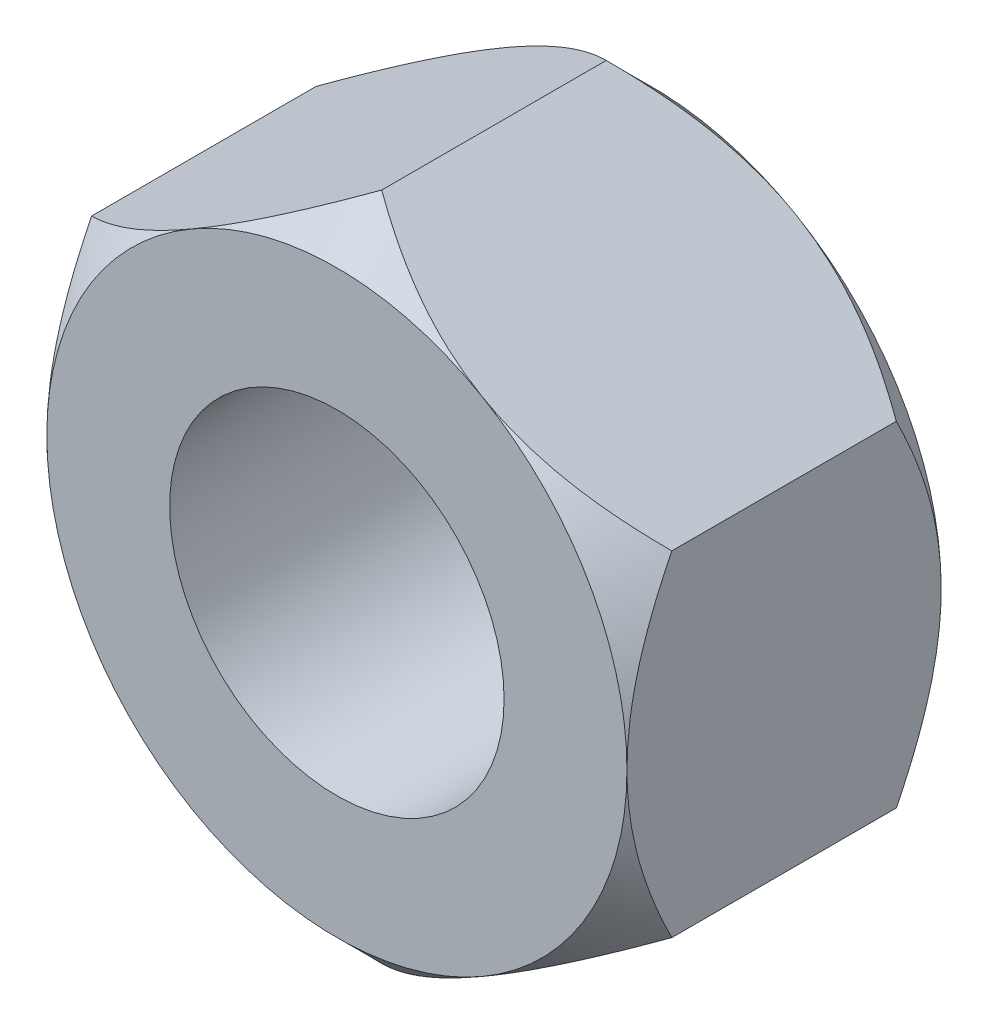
ISO-10303-21;
HEADER;
FILE_DESCRIPTION(('STEP AP214'),'2;1');
FILE_NAME('part.step','',(''),(''),'','','');
FILE_SCHEMA(('AUTOMOTIVE_DESIGN { 1 0 10303 214 1 1 1 1 }'));
ENDSEC;
DATA;
#1=APPLICATION_CONTEXT('core data for automotive mechanical design processes');
#2=APPLICATION_PROTOCOL_DEFINITION('international standard','automotive_design',2000,#1);
#3=PRODUCT_CONTEXT('',#1,'mechanical');
#4=PRODUCT('Part','Part','',(#3));
#5=PRODUCT_RELATED_PRODUCT_CATEGORY('part','',(#4));
#6=PRODUCT_DEFINITION_FORMATION('','',#4);
#7=PRODUCT_DEFINITION_CONTEXT('part definition',#1,'design');
#8=PRODUCT_DEFINITION('design','',#6,#7);
#9=PRODUCT_DEFINITION_SHAPE('','',#8);
#10=(LENGTH_UNIT() NAMED_UNIT(*) SI_UNIT(.MILLI.,.METRE.));
#11=(NAMED_UNIT(*) PLANE_ANGLE_UNIT() SI_UNIT($,.RADIAN.));
#12=(NAMED_UNIT(*) SI_UNIT($,.STERADIAN.) SOLID_ANGLE_UNIT());
#13=UNCERTAINTY_MEASURE_WITH_UNIT(LENGTH_MEASURE(1.E-05),#10,'distance_accuracy_value','');
#14=(GEOMETRIC_REPRESENTATION_CONTEXT(3) GLOBAL_UNCERTAINTY_ASSIGNED_CONTEXT((#13)) GLOBAL_UNIT_ASSIGNED_CONTEXT((#10,
#11,#12)) REPRESENTATION_CONTEXT('',''));
#15=CARTESIAN_POINT('',(0.,0.,0.));
#16=DIRECTION('',(0.,0.,1.));
#17=DIRECTION('',(1.,0.,0.));
#18=AXIS2_PLACEMENT_3D('',#15,#16,#17);
#19=CARTESIAN_POINT('',(-12.,6.92820323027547,6.5));
#20=DIRECTION('',(-0.500000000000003,0.866025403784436,0.));
#21=DIRECTION('',(-0.866025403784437,-0.500000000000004,0.));
#22=AXIS2_PLACEMENT_3D('',#19,#20,#21);
#23=PLANE('',#22);
#24=DIRECTION('',(0.,0.,-1.));
#25=VECTOR('',#24,1.);
#26=CARTESIAN_POINT('',(-12.,6.92820323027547,6.5));
#27=LINE('',#26,#25);
#28=CARTESIAN_POINT('',(-12.,6.92820323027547,4.64359353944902));
#29=VERTEX_POINT('',#28);
#30=CARTESIAN_POINT('',(-12.,6.92820323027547,-4.64359353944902));
#31=VERTEX_POINT('',#30);
#32=EDGE_CURVE('E202',#29,#31,#27,.T.);
#33=ORIENTED_EDGE('',*,*,#32,.F.);
#34=CARTESIAN_POINT('',(-12.0002,6.92808776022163,4.64347806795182));
#35=CARTESIAN_POINT('',(-11.7938936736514,7.04719877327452,4.76257149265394));
#36=CARTESIAN_POINT('',(-11.5859716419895,7.16724261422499,4.87803081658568));
#37=CARTESIAN_POINT('',(-11.1666446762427,7.40934115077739,5.10052689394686));
#38=CARTESIAN_POINT('',(-10.9552379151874,7.53139690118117,5.20755904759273));
#39=CARTESIAN_POINT('',(-10.5276928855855,7.77824013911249,5.41249969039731));
#40=CARTESIAN_POINT('',(-10.3115344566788,7.90303926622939,5.51035243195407));
#41=CARTESIAN_POINT('',(-9.87566730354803,8.15468728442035,5.69480899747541));
#42=CARTESIAN_POINT('',(-9.65595912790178,8.28153585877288,5.7814145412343));
#43=CARTESIAN_POINT('',(-9.21652498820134,8.53524327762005,5.94063652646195));
#44=CARTESIAN_POINT('',(-8.99685302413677,8.66207094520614,6.01345053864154));
#45=CARTESIAN_POINT('',(-8.55442972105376,8.91750415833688,6.14527359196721));
#46=CARTESIAN_POINT('',(-8.33167871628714,9.04610951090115,6.20428411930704));
#47=CARTESIAN_POINT('',(-7.88405009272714,9.30454801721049,6.30701456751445));
#48=CARTESIAN_POINT('',(-7.65917845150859,9.43437771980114,6.35076890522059));
#49=CARTESIAN_POINT('',(-7.20754733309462,9.69512706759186,6.42202554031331));
#50=CARTESIAN_POINT('',(-6.98078814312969,9.82604654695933,6.44953026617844));
#51=CARTESIAN_POINT('',(-6.42819328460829,10.1450873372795,6.4956480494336));
#52=CARTESIAN_POINT('',(-6.1017603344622,10.3335534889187,6.50532569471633));
#53=CARTESIAN_POINT('',(-5.44948483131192,10.7101449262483,6.48908104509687));
#54=CARTESIAN_POINT('',(-5.1236425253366,10.8982700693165,6.4631462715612));
#55=CARTESIAN_POINT('',(-4.47502949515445,11.2727469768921,6.3772075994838));
#56=CARTESIAN_POINT('',(-4.15226261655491,11.459096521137,6.31716560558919));
#57=CARTESIAN_POINT('',(-3.5122766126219,11.8285926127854,6.16627617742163));
#58=CARTESIAN_POINT('',(-3.19505706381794,12.0117394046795,6.07543110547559));
#59=CARTESIAN_POINT('',(-2.63195435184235,12.33684690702,5.8885415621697));
#60=CARTESIAN_POINT('',(-2.38482394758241,12.4795277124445,5.79741358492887));
#61=CARTESIAN_POINT('',(-1.89499909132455,12.7623282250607,5.60047368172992));
#62=CARTESIAN_POINT('',(-1.65230477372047,12.9024478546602,5.49466131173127));
#63=CARTESIAN_POINT('',(-1.17211651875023,13.179684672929,5.27072428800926));
#64=CARTESIAN_POINT('',(-0.934608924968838,13.3168097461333,5.15263835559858));
#65=CARTESIAN_POINT('',(-0.463991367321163,13.5885209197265,4.90570429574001));
#66=CARTESIAN_POINT('',(-0.230878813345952,13.7231085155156,4.77686276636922));
#67=CARTESIAN_POINT('',(0.000200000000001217,13.8565219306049,4.64347806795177));
#68=B_SPLINE_CURVE_WITH_KNOTS('',3,(#34,#35,#36,#37,#38,#39,#40,#41,#42,#43,#44,#45,#46,#47,#48,
#49,#50,#51,#52,#53,#54,#55,#56,#57,#58,#59,#60,#61,#62,#63,#64,#65,#66,#67),.UNSPECIFIED.,.F.,
.F.,(4,2,2,2,2,2,2,2,2,2,2,2,2,2,2,2,4),(0.,0.799031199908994,1.5984955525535,2.40253734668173,
3.20645605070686,3.99780391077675,4.78906652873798,5.57853238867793,6.36788023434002,
7.49728680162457,8.62708921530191,9.75815602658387,10.8891361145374,11.7873913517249,
12.6856737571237,13.5812036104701,14.4761880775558),.UNSPECIFIED.);
#69=CARTESIAN_POINT('',(-6.00000000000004,10.3923048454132,6.5));
#70=VERTEX_POINT('',#69);
#71=EDGE_CURVE('E128',#29,#70,#68,.T.);
#72=ORIENTED_EDGE('',*,*,#71,.T.);
#73=CARTESIAN_POINT('',(0.,13.856406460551,4.64359353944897));
#74=VERTEX_POINT('',#73);
#75=EDGE_CURVE('E292',#70,#74,#68,.T.);
#76=ORIENTED_EDGE('',*,*,#75,.T.);
#77=DIRECTION('',(0.,0.,-1.));
#78=VECTOR('',#77,1.);
#79=CARTESIAN_POINT('',(0.,13.856406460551,6.5));
#80=LINE('',#79,#78);
#81=CARTESIAN_POINT('',(0.,13.856406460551,-4.64359353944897));
#82=VERTEX_POINT('',#81);
#83=EDGE_CURVE('E255',#74,#82,#80,.T.);
#84=ORIENTED_EDGE('',*,*,#83,.T.);
#85=CARTESIAN_POINT('',(0.0002,13.8565219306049,-4.64347806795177));
#86=CARTESIAN_POINT('',(-0.206106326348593,13.737410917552,-4.76257149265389));
#87=CARTESIAN_POINT('',(-0.414028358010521,13.6173670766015,-4.87803081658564));
#88=CARTESIAN_POINT('',(-0.833355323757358,13.3752685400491,-5.10052689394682));
#89=CARTESIAN_POINT('',(-1.04476208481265,13.2532127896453,-5.2075590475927));
#90=CARTESIAN_POINT('',(-1.47230711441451,13.006369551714,-5.41249969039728));
#91=CARTESIAN_POINT('',(-1.68846554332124,12.8815704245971,-5.51035243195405));
#92=CARTESIAN_POINT('',(-2.124332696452,12.6299224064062,-5.69480899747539));
#93=CARTESIAN_POINT('',(-2.34404087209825,12.5030738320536,-5.78141454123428));
#94=CARTESIAN_POINT('',(-2.7834750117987,12.2493664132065,-5.94063652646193));
#95=CARTESIAN_POINT('',(-3.00314697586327,12.1225387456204,-6.01345053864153));
#96=CARTESIAN_POINT('',(-3.44557027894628,11.8671055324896,-6.1452735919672));
#97=CARTESIAN_POINT('',(-3.66832128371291,11.7385001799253,-6.20428411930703));
#98=CARTESIAN_POINT('',(-4.11594990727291,11.480061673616,-6.30701456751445));
#99=CARTESIAN_POINT('',(-4.34082154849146,11.3502319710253,-6.35076890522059));
#100=CARTESIAN_POINT('',(-4.79245266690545,11.0894826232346,-6.42202554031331));
#101=CARTESIAN_POINT('',(-5.01921185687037,10.9585631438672,-6.44953026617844));
#102=CARTESIAN_POINT('',(-5.57180671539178,10.639522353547,-6.4956480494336));
#103=CARTESIAN_POINT('',(-5.89823966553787,10.4510562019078,-6.50532569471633));
#104=CARTESIAN_POINT('',(-6.55051516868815,10.0744647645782,-6.48908104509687));
#105=CARTESIAN_POINT('',(-6.87635747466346,9.88633962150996,-6.46314627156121));
#106=CARTESIAN_POINT('',(-7.52497050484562,9.5118627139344,-6.37720759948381));
#107=CARTESIAN_POINT('',(-7.84773738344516,9.32551316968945,-6.31716560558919));
#108=CARTESIAN_POINT('',(-8.48772338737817,8.95601707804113,-6.16627617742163));
#109=CARTESIAN_POINT('',(-8.80494293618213,8.77287028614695,-6.0754311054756));
#110=CARTESIAN_POINT('',(-9.36804564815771,8.44776278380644,-5.88854156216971));
#111=CARTESIAN_POINT('',(-9.61517605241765,8.30508197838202,-5.79741358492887));
#112=CARTESIAN_POINT('',(-10.1050009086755,8.02228146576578,-5.60047368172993));
#113=CARTESIAN_POINT('',(-10.3476952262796,7.88216183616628,-5.49466131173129));
#114=CARTESIAN_POINT('',(-10.8278834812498,7.60492501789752,-5.27072428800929));
#115=CARTESIAN_POINT('',(-11.0653910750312,7.46779994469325,-5.15263835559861));
#116=CARTESIAN_POINT('',(-11.5360086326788,7.19608877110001,-4.90570429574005));
#117=CARTESIAN_POINT('',(-11.7691211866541,7.06150117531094,-4.77686276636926));
#118=CARTESIAN_POINT('',(-12.0002,6.92808776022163,-4.64347806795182));
#119=B_SPLINE_CURVE_WITH_KNOTS('',3,(#85,#86,#87,#88,#89,#90,#91,#92,#93,#94,#95,#96,#97,#98,
#99,#100,#101,#102,#103,#104,#105,#106,#107,#108,#109,#110,#111,#112,#113,#114,#115,#116,#117,
#118),.UNSPECIFIED.,.F.,.F.,(4,2,2,2,2,2,2,2,2,2,2,2,2,2,2,2,4),(0.,0.799031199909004,
1.59849555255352,2.40253734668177,3.20645605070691,3.99780391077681,4.78906652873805,
5.57853238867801,6.36788023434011,7.49728680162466,8.627089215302,9.75815602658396,
10.8891361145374,11.7873913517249,12.6856737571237,13.5812036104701,14.4761880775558),.UNSPECIFIED.);
#120=CARTESIAN_POINT('',(-6.00000000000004,10.3923048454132,-6.5));
#121=VERTEX_POINT('',#120);
#122=EDGE_CURVE('E197',#82,#121,#119,.T.);
#123=ORIENTED_EDGE('',*,*,#122,.T.);
#124=EDGE_CURVE('E194',#121,#31,#119,.T.);
#125=ORIENTED_EDGE('',*,*,#124,.T.);
#126=EDGE_LOOP('',(#33,#72,#76,#84,#123,#125));
#127=FACE_BOUND('',#126,.T.);
#128=ADVANCED_FACE('F34',(#127),#23,.T.);
#129=CARTESIAN_POINT('',(-12.,6.92820323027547,6.5));
#130=DIRECTION('',(1.,0.,0.));
#131=DIRECTION('',(0.,1.,0.));
#132=AXIS2_PLACEMENT_3D('',#129,#130,#131);
#133=PLANE('',#132);
#134=CARTESIAN_POINT('',(-12.,-15.7600536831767,-1.3085661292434));
#135=CARTESIAN_POINT('',(-12.,-15.5719246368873,-1.15888968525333));
#136=CARTESIAN_POINT('',(-12.,-15.3833191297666,-1.00981248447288));
#137=CARTESIAN_POINT('',(-12.,-15.0050708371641,-0.712974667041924));
#138=CARTESIAN_POINT('',(-12.,-14.8154280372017,-0.565214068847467));
#139=CARTESIAN_POINT('',(-12.,-14.2447498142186,-0.124032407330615));
#140=CARTESIAN_POINT('',(-12.,-13.8620389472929,0.167229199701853));
#141=CARTESIAN_POINT('',(-12.,-13.0884758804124,0.744957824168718));
#142=CARTESIAN_POINT('',(-12.,-12.6975839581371,1.03137176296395));
#143=CARTESIAN_POINT('',(-12.,-11.9095853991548,1.59548779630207));
#144=CARTESIAN_POINT('',(-12.,-11.5124791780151,1.8731904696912));
#145=CARTESIAN_POINT('',(-12.,-10.6802424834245,2.43864081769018));
#146=CARTESIAN_POINT('',(-12.,-10.2445271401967,2.7255317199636));
#147=CARTESIAN_POINT('',(-12.,-9.36282496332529,3.28336864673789));
#148=CARTESIAN_POINT('',(-12.,-8.91683622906,3.55431168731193));
#149=CARTESIAN_POINT('',(-12.,-8.01416781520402,4.07463288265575));
#150=CARTESIAN_POINT('',(-12.,-7.55752446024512,4.32407364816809));
#151=CARTESIAN_POINT('',(-12.,-6.63048699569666,4.79583185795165));
#152=CARTESIAN_POINT('',(-12.,-6.16009999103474,5.01816301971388));
#153=CARTESIAN_POINT('',(-12.,-5.47402478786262,5.31175922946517));
#154=CARTESIAN_POINT('',(-12.,-5.26448352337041,5.39744186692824));
#155=CARTESIAN_POINT('',(-12.,-4.84247892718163,5.5612315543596));
#156=CARTESIAN_POINT('',(-12.,-4.63001566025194,5.63933877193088));
#157=CARTESIAN_POINT('',(-12.,-3.98811829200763,5.86101135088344));
#158=CARTESIAN_POINT('',(-12.,-3.55413791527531,5.99194453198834));
#159=CARTESIAN_POINT('',(-12.,-2.90025179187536,6.15625068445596));
#160=CARTESIAN_POINT('',(-12.,-2.68420282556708,6.20529896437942));
#161=CARTESIAN_POINT('',(-12.,-2.24996964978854,6.29274074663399));
#162=CARTESIAN_POINT('',(-12.,-2.03178580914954,6.3311360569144));
#163=CARTESIAN_POINT('',(-12.,-1.5937471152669,6.39656514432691));
#164=CARTESIAN_POINT('',(-12.,-1.3738924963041,6.42360048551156));
#165=CARTESIAN_POINT('',(-12.,-0.933041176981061,6.46578063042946));
#166=CARTESIAN_POINT('',(-12.,-0.712044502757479,6.48092570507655));
#167=CARTESIAN_POINT('',(-12.,-0.283154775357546,6.49845319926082));
#168=CARTESIAN_POINT('',(-12.,-0.0752912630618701,6.50156289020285));
#169=CARTESIAN_POINT('',(-12.,0.340340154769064,6.49697359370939));
#170=CARTESIAN_POINT('',(-12.,0.548108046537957,6.4892733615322));
#171=CARTESIAN_POINT('',(-12.,0.96295661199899,6.46320459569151));
#172=CARTESIAN_POINT('',(-12.,1.17003733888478,6.44483690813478));
#173=CARTESIAN_POINT('',(-12.,1.58303246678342,6.39777512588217));
#174=CARTESIAN_POINT('',(-12.,1.78894669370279,6.36907952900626));
#175=CARTESIAN_POINT('',(-12.,2.41214470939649,6.26690273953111));
#176=CARTESIAN_POINT('',(-12.,2.82694865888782,6.17785339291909));
#177=CARTESIAN_POINT('',(-12.,3.64707301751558,5.96429157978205));
#178=CARTESIAN_POINT('',(-12.,4.05239340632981,5.83977903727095));
#179=CARTESIAN_POINT('',(-12.,4.85376572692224,5.56100868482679));
#180=CARTESIAN_POINT('',(-12.,5.24979002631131,5.4066723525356));
#181=CARTESIAN_POINT('',(-12.,6.03172803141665,5.07403939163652));
#182=CARTESIAN_POINT('',(-12.,6.41763729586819,4.8957324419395));
#183=CARTESIAN_POINT('',(-12.,7.1811061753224,4.51938360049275));
#184=CARTESIAN_POINT('',(-12.,7.55863649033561,4.32128275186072));
#185=CARTESIAN_POINT('',(-12.,8.30507860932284,3.90968082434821));
#186=CARTESIAN_POINT('',(-12.,8.67399167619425,3.69618202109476));
#187=CARTESIAN_POINT('',(-12.,9.38627446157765,3.26762311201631));
#188=CARTESIAN_POINT('',(-12.,9.73000584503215,3.05316093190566));
#189=CARTESIAN_POINT('',(-12.,10.4115621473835,2.61502199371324));
#190=CARTESIAN_POINT('',(-12.,10.7493866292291,2.39134455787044));
#191=CARTESIAN_POINT('',(-12.,11.4172199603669,1.93820326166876));
#192=CARTESIAN_POINT('',(-12.,11.7472694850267,1.70879913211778));
#193=CARTESIAN_POINT('',(-12.,12.4028285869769,1.24377458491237));
#194=CARTESIAN_POINT('',(-12.,12.7283393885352,1.00815589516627));
#195=CARTESIAN_POINT('',(-12.,13.0519432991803,0.769990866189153));
#196=B_SPLINE_CURVE_WITH_KNOTS('',3,(#134,#135,#136,#137,#138,#139,#140,#141,#142,#143,#144,
#145,#146,#147,#148,#149,#150,#151,#152,#153,#154,#155,#156,#157,#158,#159,#160,#161,#162,#163,
#164,#165,#166,#167,#168,#169,#170,#171,#172,#173,#174,#175,#176,#177,#178,#179,#180,#181,#182,
#183,#184,#185,#186,#187,#188,#189,#190,#191,#192,#193,#194,#195),.UNSPECIFIED.,.F.,.F.,(4,2,2,
2,2,2,2,2,2,2,2,2,2,2,2,2,2,2,2,2,2,2,2,2,2,2,2,2,2,2,4),(0.,0.721219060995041,1.4424482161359,
2.88519191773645,4.33887174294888,5.79245476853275,7.35723821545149,8.92231351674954,
10.4826657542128,12.0422251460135,12.721239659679,13.4002391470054,14.7581117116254,
15.4225405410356,16.0868565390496,16.7510810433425,17.4152904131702,18.0386721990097,
18.6621257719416,19.285529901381,19.9090247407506,21.1797660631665,22.4505101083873,
23.7246466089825,24.9993334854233,26.2779371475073,27.5563522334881,28.7716258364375,
29.9869889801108,31.1927431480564,32.3981655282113),.UNSPECIFIED.);
#197=CARTESIAN_POINT('',(-12.,0.,6.5));
#198=VERTEX_POINT('',#197);
#199=EDGE_CURVE('E122',#29,#198,#196,.F.);
#200=ORIENTED_EDGE('',*,*,#199,.F.);
#201=ORIENTED_EDGE('',*,*,#32,.T.);
#202=CARTESIAN_POINT('',(-12.,-15.7600536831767,1.3085661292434));
#203=CARTESIAN_POINT('',(-12.,-15.5719246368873,1.15888968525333));
#204=CARTESIAN_POINT('',(-12.,-15.3833191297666,1.00981248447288));
#205=CARTESIAN_POINT('',(-12.,-15.0050708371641,0.712974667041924));
#206=CARTESIAN_POINT('',(-12.,-14.8154280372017,0.565214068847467));
#207=CARTESIAN_POINT('',(-12.,-14.2447498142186,0.124032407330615));
#208=CARTESIAN_POINT('',(-12.,-13.8620389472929,-0.167229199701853));
#209=CARTESIAN_POINT('',(-12.,-13.0884758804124,-0.744957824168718));
#210=CARTESIAN_POINT('',(-12.,-12.6975839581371,-1.03137176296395));
#211=CARTESIAN_POINT('',(-12.,-11.9095853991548,-1.59548779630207));
#212=CARTESIAN_POINT('',(-12.,-11.5124791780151,-1.8731904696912));
#213=CARTESIAN_POINT('',(-12.,-10.6802424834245,-2.43864081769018));
#214=CARTESIAN_POINT('',(-12.,-10.2445271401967,-2.7255317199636));
#215=CARTESIAN_POINT('',(-12.,-9.36282496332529,-3.28336864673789));
#216=CARTESIAN_POINT('',(-12.,-8.91683622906,-3.55431168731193));
#217=CARTESIAN_POINT('',(-12.,-8.01416781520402,-4.07463288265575));
#218=CARTESIAN_POINT('',(-12.,-7.55752446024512,-4.32407364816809));
#219=CARTESIAN_POINT('',(-12.,-6.63048699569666,-4.79583185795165));
#220=CARTESIAN_POINT('',(-12.,-6.16009999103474,-5.01816301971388));
#221=CARTESIAN_POINT('',(-12.,-5.47402478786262,-5.31175922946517));
#222=CARTESIAN_POINT('',(-12.,-5.26448352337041,-5.39744186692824));
#223=CARTESIAN_POINT('',(-12.,-4.84247892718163,-5.5612315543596));
#224=CARTESIAN_POINT('',(-12.,-4.63001566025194,-5.63933877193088));
#225=CARTESIAN_POINT('',(-12.,-3.98811829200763,-5.86101135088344));
#226=CARTESIAN_POINT('',(-12.,-3.55413791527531,-5.99194453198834));
#227=CARTESIAN_POINT('',(-12.,-2.90025179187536,-6.15625068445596));
#228=CARTESIAN_POINT('',(-12.,-2.68420282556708,-6.20529896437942));
#229=CARTESIAN_POINT('',(-12.,-2.24996964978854,-6.29274074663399));
#230=CARTESIAN_POINT('',(-12.,-2.03178580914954,-6.3311360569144));
#231=CARTESIAN_POINT('',(-12.,-1.5937471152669,-6.39656514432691));
#232=CARTESIAN_POINT('',(-12.,-1.3738924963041,-6.42360048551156));
#233=CARTESIAN_POINT('',(-12.,-0.933041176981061,-6.46578063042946));
#234=CARTESIAN_POINT('',(-12.,-0.712044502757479,-6.48092570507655));
#235=CARTESIAN_POINT('',(-12.,-0.283154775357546,-6.49845319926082));
#236=CARTESIAN_POINT('',(-12.,-0.0752912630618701,-6.50156289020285));
#237=CARTESIAN_POINT('',(-12.,0.340340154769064,-6.49697359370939));
#238=CARTESIAN_POINT('',(-12.,0.548108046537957,-6.4892733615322));
#239=CARTESIAN_POINT('',(-12.,0.96295661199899,-6.46320459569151));
#240=CARTESIAN_POINT('',(-12.,1.17003733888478,-6.44483690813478));
#241=CARTESIAN_POINT('',(-12.,1.58303246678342,-6.39777512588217));
#242=CARTESIAN_POINT('',(-12.,1.78894669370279,-6.36907952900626));
#243=CARTESIAN_POINT('',(-12.,2.41214470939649,-6.26690273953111));
#244=CARTESIAN_POINT('',(-12.,2.82694865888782,-6.17785339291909));
#245=CARTESIAN_POINT('',(-12.,3.64707301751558,-5.96429157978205));
#246=CARTESIAN_POINT('',(-12.,4.05239340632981,-5.83977903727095));
#247=CARTESIAN_POINT('',(-12.,4.85376572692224,-5.56100868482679));
#248=CARTESIAN_POINT('',(-12.,5.24979002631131,-5.4066723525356));
#249=CARTESIAN_POINT('',(-12.,6.03172803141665,-5.07403939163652));
#250=CARTESIAN_POINT('',(-12.,6.41763729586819,-4.8957324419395));
#251=CARTESIAN_POINT('',(-12.,7.1811061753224,-4.51938360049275));
#252=CARTESIAN_POINT('',(-12.,7.55863649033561,-4.32128275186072));
#253=CARTESIAN_POINT('',(-12.,8.30507860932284,-3.90968082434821));
#254=CARTESIAN_POINT('',(-12.,8.67399167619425,-3.69618202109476));
#255=CARTESIAN_POINT('',(-12.,9.38627446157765,-3.26762311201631));
#256=CARTESIAN_POINT('',(-12.,9.73000584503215,-3.05316093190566));
#257=CARTESIAN_POINT('',(-12.,10.4115621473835,-2.61502199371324));
#258=CARTESIAN_POINT('',(-12.,10.7493866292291,-2.39134455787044));
#259=CARTESIAN_POINT('',(-12.,11.4172199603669,-1.93820326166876));
#260=CARTESIAN_POINT('',(-12.,11.7472694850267,-1.70879913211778));
#261=CARTESIAN_POINT('',(-12.,12.4028285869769,-1.24377458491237));
#262=CARTESIAN_POINT('',(-12.,12.7283393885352,-1.00815589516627));
#263=CARTESIAN_POINT('',(-12.,13.0519432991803,-0.769990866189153));
#264=B_SPLINE_CURVE_WITH_KNOTS('',3,(#202,#203,#204,#205,#206,#207,#208,#209,#210,#211,#212,
#213,#214,#215,#216,#217,#218,#219,#220,#221,#222,#223,#224,#225,#226,#227,#228,#229,#230,#231,
#232,#233,#234,#235,#236,#237,#238,#239,#240,#241,#242,#243,#244,#245,#246,#247,#248,#249,#250,
#251,#252,#253,#254,#255,#256,#257,#258,#259,#260,#261,#262,#263),.UNSPECIFIED.,.F.,.F.,(4,2,2,
2,2,2,2,2,2,2,2,2,2,2,2,2,2,2,2,2,2,2,2,2,2,2,2,2,2,2,4),(0.,0.721219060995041,1.4424482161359,
2.88519191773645,4.33887174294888,5.79245476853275,7.35723821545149,8.92231351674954,
10.4826657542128,12.0422251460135,12.721239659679,13.4002391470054,14.7581117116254,
15.4225405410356,16.0868565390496,16.7510810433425,17.4152904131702,18.0386721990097,
18.6621257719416,19.285529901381,19.9090247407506,21.1797660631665,22.4505101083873,
23.7246466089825,24.9993334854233,26.2779371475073,27.5563522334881,28.7716258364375,
29.9869889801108,31.1927431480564,32.3981655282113),.UNSPECIFIED.);
#265=CARTESIAN_POINT('',(-12.,0.,-6.5));
#266=VERTEX_POINT('',#265);
#267=EDGE_CURVE('E196',#266,#31,#264,.T.);
#268=ORIENTED_EDGE('',*,*,#267,.F.);
#269=CARTESIAN_POINT('',(-12.,-6.92820323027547,-4.64359353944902));
#270=VERTEX_POINT('',#269);
#271=EDGE_CURVE('E188',#270,#266,#264,.T.);
#272=ORIENTED_EDGE('',*,*,#271,.F.);
#273=DIRECTION('',(0.,0.,-1.));
#274=VECTOR('',#273,1.);
#275=CARTESIAN_POINT('',(-12.,-6.92820323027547,6.5));
#276=LINE('',#275,#274);
#277=CARTESIAN_POINT('',(-12.,-6.92820323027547,4.64359353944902));
#278=VERTEX_POINT('',#277);
#279=EDGE_CURVE('E153',#278,#270,#276,.T.);
#280=ORIENTED_EDGE('',*,*,#279,.F.);
#281=EDGE_CURVE('E135',#198,#278,#196,.F.);
#282=ORIENTED_EDGE('',*,*,#281,.F.);
#283=EDGE_LOOP('',(#200,#201,#268,#272,#280,#282));
#284=FACE_BOUND('',#283,.T.);
#285=ADVANCED_FACE('F151',(#284),#133,.F.);
#286=CARTESIAN_POINT('',(-12.,-6.92820323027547,6.5));
#287=DIRECTION('',(0.500000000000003,0.866025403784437,0.));
#288=DIRECTION('',(-0.866025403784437,0.500000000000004,0.));
#289=AXIS2_PLACEMENT_3D('',#286,#287,#288);
#290=PLANE('',#289);
#291=CARTESIAN_POINT('',(-12.0002,-6.92808776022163,4.64347806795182));
#292=CARTESIAN_POINT('',(-11.7938936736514,-7.04719877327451,4.76257149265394));
#293=CARTESIAN_POINT('',(-11.5859716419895,-7.16724261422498,4.87803081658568));
#294=CARTESIAN_POINT('',(-11.1666446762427,-7.40934115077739,5.10052689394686));
#295=CARTESIAN_POINT('',(-10.9552379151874,-7.53139690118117,5.20755904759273));
#296=CARTESIAN_POINT('',(-10.5276928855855,-7.77824013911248,5.41249969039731));
#297=CARTESIAN_POINT('',(-10.3115344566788,-7.90303926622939,5.51035243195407));
#298=CARTESIAN_POINT('',(-9.87566730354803,-8.15468728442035,5.69480899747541));
#299=CARTESIAN_POINT('',(-9.65595912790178,-8.28153585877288,5.78141454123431));
#300=CARTESIAN_POINT('',(-9.21652498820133,-8.53524327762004,5.94063652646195));
#301=CARTESIAN_POINT('',(-8.99685302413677,-8.66207094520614,6.01345053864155));
#302=CARTESIAN_POINT('',(-8.55442972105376,-8.91750415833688,6.14527359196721));
#303=CARTESIAN_POINT('',(-8.33167871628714,-9.04610951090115,6.20428411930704));
#304=CARTESIAN_POINT('',(-7.88405009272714,-9.30454801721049,6.30701456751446));
#305=CARTESIAN_POINT('',(-7.65917845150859,-9.43437771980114,6.3507689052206));
#306=CARTESIAN_POINT('',(-7.20754733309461,-9.69512706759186,6.42202554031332));
#307=CARTESIAN_POINT('',(-6.98078814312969,-9.82604654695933,6.44953026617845));
#308=CARTESIAN_POINT('',(-6.42819328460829,-10.1450873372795,6.49564804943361));
#309=CARTESIAN_POINT('',(-6.10176033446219,-10.3335534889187,6.50532569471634));
#310=CARTESIAN_POINT('',(-5.44948483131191,-10.7101449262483,6.48908104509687));
#311=CARTESIAN_POINT('',(-5.1236425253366,-10.8982700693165,6.4631462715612));
#312=CARTESIAN_POINT('',(-4.47502949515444,-11.2727469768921,6.37720759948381));
#313=CARTESIAN_POINT('',(-4.1522626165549,-11.459096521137,6.31716560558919));
#314=CARTESIAN_POINT('',(-3.51227661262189,-11.8285926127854,6.16627617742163));
#315=CARTESIAN_POINT('',(-3.19505706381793,-12.0117394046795,6.07543110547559));
#316=CARTESIAN_POINT('',(-2.63195435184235,-12.33684690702,5.8885415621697));
#317=CARTESIAN_POINT('',(-2.3848239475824,-12.4795277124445,5.79741358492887));
#318=CARTESIAN_POINT('',(-1.89499909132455,-12.7623282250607,5.60047368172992));
#319=CARTESIAN_POINT('',(-1.65230477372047,-12.9024478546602,5.49466131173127));
#320=CARTESIAN_POINT('',(-1.17211651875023,-13.179684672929,5.27072428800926));
#321=CARTESIAN_POINT('',(-0.934608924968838,-13.3168097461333,5.15263835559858));
#322=CARTESIAN_POINT('',(-0.463991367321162,-13.5885209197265,4.90570429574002));
#323=CARTESIAN_POINT('',(-0.230878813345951,-13.7231085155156,4.77686276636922));
#324=CARTESIAN_POINT('',(0.00020000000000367,-13.8565219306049,4.64347806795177));
#325=B_SPLINE_CURVE_WITH_KNOTS('',3,(#291,#292,#293,#294,#295,#296,#297,#298,#299,#300,#301,
#302,#303,#304,#305,#306,#307,#308,#309,#310,#311,#312,#313,#314,#315,#316,#317,#318,#319,#320,
#321,#322,#323,#324),.UNSPECIFIED.,.F.,.F.,(4,2,2,2,2,2,2,2,2,2,2,2,2,2,2,2,4),(0.,
0.799031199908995,1.5984955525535,2.40253734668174,3.20645605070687,3.99780391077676,
4.78906652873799,5.57853238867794,6.36788023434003,7.49728680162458,8.62708921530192,
9.75815602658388,10.8891361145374,11.7873913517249,12.6856737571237,13.5812036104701,
14.4761880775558),.UNSPECIFIED.);
#326=CARTESIAN_POINT('',(-6.00000000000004,-10.3923048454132,6.5));
#327=VERTEX_POINT('',#326);
#328=EDGE_CURVE('E141',#278,#327,#325,.T.);
#329=ORIENTED_EDGE('',*,*,#328,.F.);
#330=ORIENTED_EDGE('',*,*,#279,.T.);
#331=CARTESIAN_POINT('',(0.000200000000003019,-13.8565219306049,-4.64347806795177));
#332=CARTESIAN_POINT('',(-0.206106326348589,-13.737410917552,-4.76257149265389));
#333=CARTESIAN_POINT('',(-0.414028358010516,-13.6173670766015,-4.87803081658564));
#334=CARTESIAN_POINT('',(-0.833355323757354,-13.3752685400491,-5.10052689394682));
#335=CARTESIAN_POINT('',(-1.04476208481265,-13.2532127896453,-5.2075590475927));
#336=CARTESIAN_POINT('',(-1.4723071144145,-13.006369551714,-5.41249969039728));
#337=CARTESIAN_POINT('',(-1.68846554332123,-12.8815704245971,-5.51035243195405));
#338=CARTESIAN_POINT('',(-2.12433269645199,-12.6299224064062,-5.69480899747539));
#339=CARTESIAN_POINT('',(-2.34404087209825,-12.5030738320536,-5.78141454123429));
#340=CARTESIAN_POINT('',(-2.7834750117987,-12.2493664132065,-5.94063652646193));
#341=CARTESIAN_POINT('',(-3.00314697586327,-12.1225387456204,-6.01345053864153));
#342=CARTESIAN_POINT('',(-3.44557027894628,-11.8671055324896,-6.1452735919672));
#343=CARTESIAN_POINT('',(-3.6683212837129,-11.7385001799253,-6.20428411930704));
#344=CARTESIAN_POINT('',(-4.11594990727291,-11.480061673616,-6.30701456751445));
#345=CARTESIAN_POINT('',(-4.34082154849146,-11.3502319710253,-6.35076890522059));
#346=CARTESIAN_POINT('',(-4.79245266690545,-11.0894826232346,-6.42202554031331));
#347=CARTESIAN_POINT('',(-5.01921185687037,-10.9585631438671,-6.44953026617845));
#348=CARTESIAN_POINT('',(-5.57180671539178,-10.639522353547,-6.49564804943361));
#349=CARTESIAN_POINT('',(-5.89823966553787,-10.4510562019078,-6.50532569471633));
#350=CARTESIAN_POINT('',(-6.55051516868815,-10.0744647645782,-6.48908104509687));
#351=CARTESIAN_POINT('',(-6.87635747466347,-9.88633962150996,-6.46314627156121));
#352=CARTESIAN_POINT('',(-7.52497050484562,-9.51186271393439,-6.37720759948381));
#353=CARTESIAN_POINT('',(-7.84773738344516,-9.32551316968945,-6.31716560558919));
#354=CARTESIAN_POINT('',(-8.48772338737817,-8.95601707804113,-6.16627617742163));
#355=CARTESIAN_POINT('',(-8.80494293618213,-8.77287028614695,-6.0754311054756));
#356=CARTESIAN_POINT('',(-9.36804564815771,-8.44776278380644,-5.88854156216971));
#357=CARTESIAN_POINT('',(-9.61517605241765,-8.30508197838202,-5.79741358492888));
#358=CARTESIAN_POINT('',(-10.1050009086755,-8.02228146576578,-5.60047368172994));
#359=CARTESIAN_POINT('',(-10.3476952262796,-7.88216183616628,-5.49466131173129));
#360=CARTESIAN_POINT('',(-10.8278834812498,-7.60492501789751,-5.27072428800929));
#361=CARTESIAN_POINT('',(-11.0653910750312,-7.46779994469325,-5.15263835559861));
#362=CARTESIAN_POINT('',(-11.5360086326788,-7.1960887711,-4.90570429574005));
#363=CARTESIAN_POINT('',(-11.7691211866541,-7.06150117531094,-4.77686276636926));
#364=CARTESIAN_POINT('',(-12.0002,-6.92808776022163,-4.64347806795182));
#365=B_SPLINE_CURVE_WITH_KNOTS('',3,(#331,#332,#333,#334,#335,#336,#337,#338,#339,#340,#341,
#342,#343,#344,#345,#346,#347,#348,#349,#350,#351,#352,#353,#354,#355,#356,#357,#358,#359,#360,
#361,#362,#363,#364),.UNSPECIFIED.,.F.,.F.,(4,2,2,2,2,2,2,2,2,2,2,2,2,2,2,2,4),(0.,
0.799031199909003,1.59849555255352,2.40253734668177,3.20645605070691,3.99780391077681,
4.78906652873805,5.57853238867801,6.36788023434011,7.49728680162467,8.62708921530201,
9.75815602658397,10.8891361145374,11.7873913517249,12.6856737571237,13.5812036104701,
14.4761880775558),.UNSPECIFIED.);
#366=CARTESIAN_POINT('',(-6.00000000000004,-10.3923048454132,-6.5));
#367=VERTEX_POINT('',#366);
#368=EDGE_CURVE('E195',#367,#270,#365,.T.);
#369=ORIENTED_EDGE('',*,*,#368,.F.);
#370=CARTESIAN_POINT('',(0.,-13.856406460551,-4.64359353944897));
#371=VERTEX_POINT('',#370);
#372=EDGE_CURVE('E231',#371,#367,#365,.T.);
#373=ORIENTED_EDGE('',*,*,#372,.F.);
#374=DIRECTION('',(0.,0.,-1.));
#375=VECTOR('',#374,1.);
#376=CARTESIAN_POINT('',(0.,-13.856406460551,6.5));
#377=LINE('',#376,#375);
#378=CARTESIAN_POINT('',(0.,-13.856406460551,4.64359353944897));
#379=VERTEX_POINT('',#378);
#380=EDGE_CURVE('E279',#379,#371,#377,.T.);
#381=ORIENTED_EDGE('',*,*,#380,.F.);
#382=EDGE_CURVE('E158',#327,#379,#325,.T.);
#383=ORIENTED_EDGE('',*,*,#382,.F.);
#384=EDGE_LOOP('',(#329,#330,#369,#373,#381,#383));
#385=FACE_BOUND('',#384,.T.);
#386=ADVANCED_FACE('F182',(#385),#290,.F.);
#387=CARTESIAN_POINT('',(12.,-6.92820323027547,6.5));
#388=DIRECTION('',(0.500000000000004,-0.866025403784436,0.));
#389=DIRECTION('',(0.866025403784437,0.500000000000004,0.));
#390=AXIS2_PLACEMENT_3D('',#387,#388,#389);
#391=PLANE('',#390);
#392=DIRECTION('',(0.,0.,-1.));
#393=VECTOR('',#392,1.);
#394=CARTESIAN_POINT('',(12.,-6.92820323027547,6.5));
#395=LINE('',#394,#393);
#396=CARTESIAN_POINT('',(12.,-6.92820323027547,4.64359353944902));
#397=VERTEX_POINT('',#396);
#398=CARTESIAN_POINT('',(12.,-6.92820323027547,-4.64359353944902));
#399=VERTEX_POINT('',#398);
#400=EDGE_CURVE('E277',#397,#399,#395,.T.);
#401=ORIENTED_EDGE('',*,*,#400,.F.);
#402=CARTESIAN_POINT('',(12.0002,-6.92808776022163,4.64347806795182));
#403=CARTESIAN_POINT('',(11.7938936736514,-7.04719877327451,4.76257149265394));
#404=CARTESIAN_POINT('',(11.5859716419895,-7.16724261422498,4.87803081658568));
#405=CARTESIAN_POINT('',(11.1666446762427,-7.40934115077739,5.10052689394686));
#406=CARTESIAN_POINT('',(10.9552379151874,-7.53139690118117,5.20755904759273));
#407=CARTESIAN_POINT('',(10.5276928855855,-7.77824013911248,5.41249969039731));
#408=CARTESIAN_POINT('',(10.3115344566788,-7.90303926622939,5.51035243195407));
#409=CARTESIAN_POINT('',(9.87566730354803,-8.15468728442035,5.69480899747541));
#410=CARTESIAN_POINT('',(9.65595912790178,-8.28153585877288,5.78141454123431));
#411=CARTESIAN_POINT('',(9.21652498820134,-8.53524327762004,5.94063652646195));
#412=CARTESIAN_POINT('',(8.99685302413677,-8.66207094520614,6.01345053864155));
#413=CARTESIAN_POINT('',(8.55442972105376,-8.91750415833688,6.14527359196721));
#414=CARTESIAN_POINT('',(8.33167871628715,-9.04610951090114,6.20428411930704));
#415=CARTESIAN_POINT('',(7.88405009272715,-9.30454801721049,6.30701456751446));
#416=CARTESIAN_POINT('',(7.65917845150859,-9.43437771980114,6.3507689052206));
#417=CARTESIAN_POINT('',(7.20754733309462,-9.69512706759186,6.42202554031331));
#418=CARTESIAN_POINT('',(6.98078814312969,-9.82604654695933,6.44953026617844));
#419=CARTESIAN_POINT('',(6.42819328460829,-10.1450873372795,6.4956480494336));
#420=CARTESIAN_POINT('',(6.1017603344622,-10.3335534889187,6.50532569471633));
#421=CARTESIAN_POINT('',(5.44948483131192,-10.7101449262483,6.48908104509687));
#422=CARTESIAN_POINT('',(5.1236425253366,-10.8982700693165,6.4631462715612));
#423=CARTESIAN_POINT('',(4.47502949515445,-11.2727469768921,6.37720759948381));
#424=CARTESIAN_POINT('',(4.15226261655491,-11.459096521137,6.31716560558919));
#425=CARTESIAN_POINT('',(3.51227661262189,-11.8285926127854,6.16627617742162));
#426=CARTESIAN_POINT('',(3.19505706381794,-12.0117394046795,6.07543110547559));
#427=CARTESIAN_POINT('',(2.63195435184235,-12.33684690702,5.8885415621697));
#428=CARTESIAN_POINT('',(2.3848239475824,-12.4795277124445,5.79741358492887));
#429=CARTESIAN_POINT('',(1.89499909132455,-12.7623282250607,5.60047368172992));
#430=CARTESIAN_POINT('',(1.65230477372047,-12.9024478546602,5.49466131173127));
#431=CARTESIAN_POINT('',(1.17211651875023,-13.179684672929,5.27072428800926));
#432=CARTESIAN_POINT('',(0.934608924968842,-13.3168097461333,5.15263835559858));
#433=CARTESIAN_POINT('',(0.463991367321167,-13.5885209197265,4.90570429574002));
#434=CARTESIAN_POINT('',(0.230878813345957,-13.7231085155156,4.77686276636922));
#435=CARTESIAN_POINT('',(-0.000199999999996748,-13.8565219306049,4.64347806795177));
#436=B_SPLINE_CURVE_WITH_KNOTS('',3,(#402,#403,#404,#405,#406,#407,#408,#409,#410,#411,#412,
#413,#414,#415,#416,#417,#418,#419,#420,#421,#422,#423,#424,#425,#426,#427,#428,#429,#430,#431,
#432,#433,#434,#435),.UNSPECIFIED.,.F.,.F.,(4,2,2,2,2,2,2,2,2,2,2,2,2,2,2,2,4),(0.,
0.799031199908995,1.5984955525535,2.40253734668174,3.20645605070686,3.99780391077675,
4.78906652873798,5.57853238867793,6.36788023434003,7.49728680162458,8.62708921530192,
9.75815602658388,10.8891361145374,11.7873913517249,12.6856737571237,13.5812036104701,
14.4761880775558),.UNSPECIFIED.);
#437=CARTESIAN_POINT('',(6.00000000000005,-10.3923048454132,6.5));
#438=VERTEX_POINT('',#437);
#439=EDGE_CURVE('E133',#397,#438,#436,.T.);
#440=ORIENTED_EDGE('',*,*,#439,.T.);
#441=EDGE_CURVE('E132',#438,#379,#436,.T.);
#442=ORIENTED_EDGE('',*,*,#441,.T.);
#443=ORIENTED_EDGE('',*,*,#380,.T.);
#444=CARTESIAN_POINT('',(-0.000199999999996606,-13.8565219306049,-4.64347806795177));
#445=CARTESIAN_POINT('',(0.206106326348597,-13.737410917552,-4.7625714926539));
#446=CARTESIAN_POINT('',(0.414028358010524,-13.6173670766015,-4.87803081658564));
#447=CARTESIAN_POINT('',(0.833355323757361,-13.3752685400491,-5.10052689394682));
#448=CARTESIAN_POINT('',(1.04476208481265,-13.2532127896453,-5.2075590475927));
#449=CARTESIAN_POINT('',(1.47230711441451,-13.006369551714,-5.41249969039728));
#450=CARTESIAN_POINT('',(1.68846554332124,-12.8815704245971,-5.51035243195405));
#451=CARTESIAN_POINT('',(2.124332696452,-12.6299224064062,-5.69480899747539));
#452=CARTESIAN_POINT('',(2.34404087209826,-12.5030738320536,-5.78141454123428));
#453=CARTESIAN_POINT('',(2.7834750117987,-12.2493664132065,-5.94063652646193));
#454=CARTESIAN_POINT('',(3.00314697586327,-12.1225387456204,-6.01345053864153));
#455=CARTESIAN_POINT('',(3.44557027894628,-11.8671055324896,-6.1452735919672));
#456=CARTESIAN_POINT('',(3.66832128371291,-11.7385001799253,-6.20428411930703));
#457=CARTESIAN_POINT('',(4.11594990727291,-11.480061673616,-6.30701456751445));
#458=CARTESIAN_POINT('',(4.34082154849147,-11.3502319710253,-6.35076890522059));
#459=CARTESIAN_POINT('',(4.79245266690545,-11.0894826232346,-6.42202554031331));
#460=CARTESIAN_POINT('',(5.01921185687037,-10.9585631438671,-6.44953026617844));
#461=CARTESIAN_POINT('',(5.57180671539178,-10.639522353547,-6.49564804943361));
#462=CARTESIAN_POINT('',(5.89823966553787,-10.4510562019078,-6.50532569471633));
#463=CARTESIAN_POINT('',(6.55051516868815,-10.0744647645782,-6.48908104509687));
#464=CARTESIAN_POINT('',(6.87635747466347,-9.88633962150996,-6.4631462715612));
#465=CARTESIAN_POINT('',(7.52497050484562,-9.51186271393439,-6.37720759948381));
#466=CARTESIAN_POINT('',(7.84773738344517,-9.32551316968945,-6.31716560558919));
#467=CARTESIAN_POINT('',(8.48772338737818,-8.95601707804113,-6.16627617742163));
#468=CARTESIAN_POINT('',(8.80494293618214,-8.77287028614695,-6.0754311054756));
#469=CARTESIAN_POINT('',(9.36804564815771,-8.44776278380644,-5.88854156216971));
#470=CARTESIAN_POINT('',(9.61517605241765,-8.30508197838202,-5.79741358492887));
#471=CARTESIAN_POINT('',(10.1050009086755,-8.02228146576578,-5.60047368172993));
#472=CARTESIAN_POINT('',(10.3476952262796,-7.88216183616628,-5.49466131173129));
#473=CARTESIAN_POINT('',(10.8278834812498,-7.60492501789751,-5.27072428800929));
#474=CARTESIAN_POINT('',(11.0653910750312,-7.46779994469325,-5.15263835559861));
#475=CARTESIAN_POINT('',(11.5360086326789,-7.1960887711,-4.90570429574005));
#476=CARTESIAN_POINT('',(11.7691211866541,-7.06150117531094,-4.77686276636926));
#477=CARTESIAN_POINT('',(12.0002,-6.92808776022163,-4.64347806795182));
#478=B_SPLINE_CURVE_WITH_KNOTS('',3,(#444,#445,#446,#447,#448,#449,#450,#451,#452,#453,#454,
#455,#456,#457,#458,#459,#460,#461,#462,#463,#464,#465,#466,#467,#468,#469,#470,#471,#472,#473,
#474,#475,#476,#477),.UNSPECIFIED.,.F.,.F.,(4,2,2,2,2,2,2,2,2,2,2,2,2,2,2,2,4),(0.,
0.799031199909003,1.59849555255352,2.40253734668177,3.20645605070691,3.9978039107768,
4.78906652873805,5.57853238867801,6.36788023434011,7.49728680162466,8.62708921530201,
9.75815602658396,10.8891361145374,11.7873913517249,12.6856737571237,13.5812036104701,
14.4761880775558),.UNSPECIFIED.);
#479=CARTESIAN_POINT('',(6.00000000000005,-10.3923048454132,-6.5));
#480=VERTEX_POINT('',#479);
#481=EDGE_CURVE('E235',#371,#480,#478,.T.);
#482=ORIENTED_EDGE('',*,*,#481,.T.);
#483=EDGE_CURVE('E227',#480,#399,#478,.T.);
#484=ORIENTED_EDGE('',*,*,#483,.T.);
#485=EDGE_LOOP('',(#401,#440,#442,#443,#482,#484));
#486=FACE_BOUND('',#485,.T.);
#487=ADVANCED_FACE('F314',(#486),#391,.T.);
#488=CARTESIAN_POINT('',(12.,6.92820323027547,6.5));
#489=DIRECTION('',(1.,0.,0.));
#490=DIRECTION('',(0.,1.,0.));
#491=AXIS2_PLACEMENT_3D('',#488,#489,#490);
#492=PLANE('',#491);
#493=DIRECTION('',(0.,0.,-1.));
#494=VECTOR('',#493,1.);
#495=CARTESIAN_POINT('',(12.,6.92820323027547,6.5));
#496=LINE('',#495,#494);
#497=CARTESIAN_POINT('',(12.,6.92820323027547,4.64359353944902));
#498=VERTEX_POINT('',#497);
#499=CARTESIAN_POINT('',(12.,6.92820323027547,-4.64359353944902));
#500=VERTEX_POINT('',#499);
#501=EDGE_CURVE('E256',#498,#500,#496,.T.);
#502=ORIENTED_EDGE('',*,*,#501,.F.);
#503=CARTESIAN_POINT('',(12.,-15.7600536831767,-1.3085661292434));
#504=CARTESIAN_POINT('',(12.,-15.5719246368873,-1.15888968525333));
#505=CARTESIAN_POINT('',(12.,-15.3833191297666,-1.00981248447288));
#506=CARTESIAN_POINT('',(12.,-15.0050708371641,-0.712974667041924));
#507=CARTESIAN_POINT('',(12.,-14.8154280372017,-0.565214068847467));
#508=CARTESIAN_POINT('',(12.,-14.2447498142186,-0.124032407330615));
#509=CARTESIAN_POINT('',(12.,-13.8620389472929,0.167229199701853));
#510=CARTESIAN_POINT('',(12.,-13.0884758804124,0.744957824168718));
#511=CARTESIAN_POINT('',(12.,-12.6975839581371,1.03137176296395));
#512=CARTESIAN_POINT('',(12.,-11.9095853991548,1.59548779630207));
#513=CARTESIAN_POINT('',(12.,-11.5124791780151,1.8731904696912));
#514=CARTESIAN_POINT('',(12.,-10.6802424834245,2.43864081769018));
#515=CARTESIAN_POINT('',(12.,-10.2445271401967,2.7255317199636));
#516=CARTESIAN_POINT('',(12.,-9.36282496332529,3.28336864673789));
#517=CARTESIAN_POINT('',(12.,-8.91683622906,3.55431168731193));
#518=CARTESIAN_POINT('',(12.,-8.01416781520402,4.07463288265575));
#519=CARTESIAN_POINT('',(12.,-7.55752446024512,4.32407364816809));
#520=CARTESIAN_POINT('',(12.,-6.63048699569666,4.79583185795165));
#521=CARTESIAN_POINT('',(12.,-6.16009999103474,5.01816301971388));
#522=CARTESIAN_POINT('',(12.,-5.47402478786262,5.31175922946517));
#523=CARTESIAN_POINT('',(12.,-5.26448352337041,5.39744186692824));
#524=CARTESIAN_POINT('',(12.,-4.84247892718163,5.5612315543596));
#525=CARTESIAN_POINT('',(12.,-4.63001566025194,5.63933877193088));
#526=CARTESIAN_POINT('',(12.,-3.98811829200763,5.86101135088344));
#527=CARTESIAN_POINT('',(12.,-3.55413791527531,5.99194453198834));
#528=CARTESIAN_POINT('',(12.,-2.90025179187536,6.15625068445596));
#529=CARTESIAN_POINT('',(12.,-2.68420282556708,6.20529896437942));
#530=CARTESIAN_POINT('',(12.,-2.24996964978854,6.29274074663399));
#531=CARTESIAN_POINT('',(12.,-2.03178580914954,6.3311360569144));
#532=CARTESIAN_POINT('',(12.,-1.5937471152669,6.39656514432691));
#533=CARTESIAN_POINT('',(12.,-1.3738924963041,6.42360048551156));
#534=CARTESIAN_POINT('',(12.,-0.933041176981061,6.46578063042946));
#535=CARTESIAN_POINT('',(12.,-0.712044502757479,6.48092570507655));
#536=CARTESIAN_POINT('',(12.,-0.283154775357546,6.49845319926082));
#537=CARTESIAN_POINT('',(12.,-0.0752912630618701,6.50156289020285));
#538=CARTESIAN_POINT('',(12.,0.340340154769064,6.49697359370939));
#539=CARTESIAN_POINT('',(12.,0.548108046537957,6.4892733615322));
#540=CARTESIAN_POINT('',(12.,0.96295661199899,6.46320459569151));
#541=CARTESIAN_POINT('',(12.,1.17003733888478,6.44483690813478));
#542=CARTESIAN_POINT('',(12.,1.58303246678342,6.39777512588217));
#543=CARTESIAN_POINT('',(12.,1.78894669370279,6.36907952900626));
#544=CARTESIAN_POINT('',(12.,2.41214470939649,6.26690273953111));
#545=CARTESIAN_POINT('',(12.,2.82694865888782,6.17785339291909));
#546=CARTESIAN_POINT('',(12.,3.64707301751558,5.96429157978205));
#547=CARTESIAN_POINT('',(12.,4.05239340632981,5.83977903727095));
#548=CARTESIAN_POINT('',(12.,4.85376572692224,5.56100868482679));
#549=CARTESIAN_POINT('',(12.,5.24979002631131,5.4066723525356));
#550=CARTESIAN_POINT('',(12.,6.03172803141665,5.07403939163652));
#551=CARTESIAN_POINT('',(12.,6.41763729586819,4.8957324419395));
#552=CARTESIAN_POINT('',(12.,7.1811061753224,4.51938360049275));
#553=CARTESIAN_POINT('',(12.,7.55863649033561,4.32128275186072));
#554=CARTESIAN_POINT('',(12.,8.30507860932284,3.90968082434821));
#555=CARTESIAN_POINT('',(12.,8.67399167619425,3.69618202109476));
#556=CARTESIAN_POINT('',(12.,9.38627446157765,3.26762311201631));
#557=CARTESIAN_POINT('',(12.,9.73000584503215,3.05316093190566));
#558=CARTESIAN_POINT('',(12.,10.4115621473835,2.61502199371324));
#559=CARTESIAN_POINT('',(12.,10.7493866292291,2.39134455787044));
#560=CARTESIAN_POINT('',(12.,11.4172199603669,1.93820326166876));
#561=CARTESIAN_POINT('',(12.,11.7472694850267,1.70879913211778));
#562=CARTESIAN_POINT('',(12.,12.4028285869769,1.24377458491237));
#563=CARTESIAN_POINT('',(12.,12.7283393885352,1.00815589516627));
#564=CARTESIAN_POINT('',(12.,13.0519432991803,0.769990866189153));
#565=B_SPLINE_CURVE_WITH_KNOTS('',3,(#503,#504,#505,#506,#507,#508,#509,#510,#511,#512,#513,
#514,#515,#516,#517,#518,#519,#520,#521,#522,#523,#524,#525,#526,#527,#528,#529,#530,#531,#532,
#533,#534,#535,#536,#537,#538,#539,#540,#541,#542,#543,#544,#545,#546,#547,#548,#549,#550,#551,
#552,#553,#554,#555,#556,#557,#558,#559,#560,#561,#562,#563,#564),.UNSPECIFIED.,.F.,.F.,(4,2,2,
2,2,2,2,2,2,2,2,2,2,2,2,2,2,2,2,2,2,2,2,2,2,2,2,2,2,2,4),(0.,0.721219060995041,1.4424482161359,
2.88519191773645,4.33887174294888,5.79245476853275,7.35723821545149,8.92231351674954,
10.4826657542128,12.0422251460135,12.721239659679,13.4002391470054,14.7581117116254,
15.4225405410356,16.0868565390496,16.7510810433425,17.4152904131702,18.0386721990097,
18.6621257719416,19.285529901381,19.9090247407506,21.1797660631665,22.4505101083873,
23.7246466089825,24.9993334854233,26.2779371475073,27.5563522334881,28.7716258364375,
29.9869889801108,31.1927431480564,32.3981655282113),.UNSPECIFIED.);
#566=CARTESIAN_POINT('',(12.,0.,6.5));
#567=VERTEX_POINT('',#566);
#568=EDGE_CURVE('E289',#498,#567,#565,.F.);
#569=ORIENTED_EDGE('',*,*,#568,.T.);
#570=EDGE_CURVE('E285',#567,#397,#565,.F.);
#571=ORIENTED_EDGE('',*,*,#570,.T.);
#572=ORIENTED_EDGE('',*,*,#400,.T.);
#573=CARTESIAN_POINT('',(12.,-15.7600536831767,1.3085661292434));
#574=CARTESIAN_POINT('',(12.,-15.5719246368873,1.15888968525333));
#575=CARTESIAN_POINT('',(12.,-15.3833191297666,1.00981248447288));
#576=CARTESIAN_POINT('',(12.,-15.0050708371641,0.712974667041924));
#577=CARTESIAN_POINT('',(12.,-14.8154280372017,0.565214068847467));
#578=CARTESIAN_POINT('',(12.,-14.2447498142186,0.124032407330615));
#579=CARTESIAN_POINT('',(12.,-13.8620389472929,-0.167229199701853));
#580=CARTESIAN_POINT('',(12.,-13.0884758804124,-0.744957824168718));
#581=CARTESIAN_POINT('',(12.,-12.6975839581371,-1.03137176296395));
#582=CARTESIAN_POINT('',(12.,-11.9095853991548,-1.59548779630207));
#583=CARTESIAN_POINT('',(12.,-11.5124791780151,-1.8731904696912));
#584=CARTESIAN_POINT('',(12.,-10.6802424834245,-2.43864081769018));
#585=CARTESIAN_POINT('',(12.,-10.2445271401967,-2.7255317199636));
#586=CARTESIAN_POINT('',(12.,-9.36282496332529,-3.28336864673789));
#587=CARTESIAN_POINT('',(12.,-8.91683622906,-3.55431168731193));
#588=CARTESIAN_POINT('',(12.,-8.01416781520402,-4.07463288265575));
#589=CARTESIAN_POINT('',(12.,-7.55752446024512,-4.32407364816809));
#590=CARTESIAN_POINT('',(12.,-6.63048699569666,-4.79583185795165));
#591=CARTESIAN_POINT('',(12.,-6.16009999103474,-5.01816301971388));
#592=CARTESIAN_POINT('',(12.,-5.47402478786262,-5.31175922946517));
#593=CARTESIAN_POINT('',(12.,-5.26448352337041,-5.39744186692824));
#594=CARTESIAN_POINT('',(12.,-4.84247892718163,-5.5612315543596));
#595=CARTESIAN_POINT('',(12.,-4.63001566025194,-5.63933877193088));
#596=CARTESIAN_POINT('',(12.,-3.98811829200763,-5.86101135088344));
#597=CARTESIAN_POINT('',(12.,-3.55413791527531,-5.99194453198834));
#598=CARTESIAN_POINT('',(12.,-2.90025179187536,-6.15625068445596));
#599=CARTESIAN_POINT('',(12.,-2.68420282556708,-6.20529896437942));
#600=CARTESIAN_POINT('',(12.,-2.24996964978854,-6.29274074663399));
#601=CARTESIAN_POINT('',(12.,-2.03178580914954,-6.3311360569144));
#602=CARTESIAN_POINT('',(12.,-1.5937471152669,-6.39656514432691));
#603=CARTESIAN_POINT('',(12.,-1.3738924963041,-6.42360048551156));
#604=CARTESIAN_POINT('',(12.,-0.933041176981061,-6.46578063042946));
#605=CARTESIAN_POINT('',(12.,-0.712044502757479,-6.48092570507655));
#606=CARTESIAN_POINT('',(12.,-0.283154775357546,-6.49845319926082));
#607=CARTESIAN_POINT('',(12.,-0.0752912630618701,-6.50156289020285));
#608=CARTESIAN_POINT('',(12.,0.340340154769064,-6.49697359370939));
#609=CARTESIAN_POINT('',(12.,0.548108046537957,-6.4892733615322));
#610=CARTESIAN_POINT('',(12.,0.96295661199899,-6.46320459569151));
#611=CARTESIAN_POINT('',(12.,1.17003733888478,-6.44483690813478));
#612=CARTESIAN_POINT('',(12.,1.58303246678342,-6.39777512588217));
#613=CARTESIAN_POINT('',(12.,1.78894669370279,-6.36907952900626));
#614=CARTESIAN_POINT('',(12.,2.41214470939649,-6.26690273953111));
#615=CARTESIAN_POINT('',(12.,2.82694865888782,-6.17785339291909));
#616=CARTESIAN_POINT('',(12.,3.64707301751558,-5.96429157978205));
#617=CARTESIAN_POINT('',(12.,4.05239340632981,-5.83977903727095));
#618=CARTESIAN_POINT('',(12.,4.85376572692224,-5.56100868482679));
#619=CARTESIAN_POINT('',(12.,5.24979002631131,-5.4066723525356));
#620=CARTESIAN_POINT('',(12.,6.03172803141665,-5.07403939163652));
#621=CARTESIAN_POINT('',(12.,6.41763729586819,-4.8957324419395));
#622=CARTESIAN_POINT('',(12.,7.1811061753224,-4.51938360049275));
#623=CARTESIAN_POINT('',(12.,7.55863649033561,-4.32128275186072));
#624=CARTESIAN_POINT('',(12.,8.30507860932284,-3.90968082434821));
#625=CARTESIAN_POINT('',(12.,8.67399167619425,-3.69618202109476));
#626=CARTESIAN_POINT('',(12.,9.38627446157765,-3.26762311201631));
#627=CARTESIAN_POINT('',(12.,9.73000584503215,-3.05316093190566));
#628=CARTESIAN_POINT('',(12.,10.4115621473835,-2.61502199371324));
#629=CARTESIAN_POINT('',(12.,10.7493866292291,-2.39134455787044));
#630=CARTESIAN_POINT('',(12.,11.4172199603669,-1.93820326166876));
#631=CARTESIAN_POINT('',(12.,11.7472694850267,-1.70879913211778));
#632=CARTESIAN_POINT('',(12.,12.4028285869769,-1.24377458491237));
#633=CARTESIAN_POINT('',(12.,12.7283393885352,-1.00815589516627));
#634=CARTESIAN_POINT('',(12.,13.0519432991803,-0.769990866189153));
#635=B_SPLINE_CURVE_WITH_KNOTS('',3,(#573,#574,#575,#576,#577,#578,#579,#580,#581,#582,#583,
#584,#585,#586,#587,#588,#589,#590,#591,#592,#593,#594,#595,#596,#597,#598,#599,#600,#601,#602,
#603,#604,#605,#606,#607,#608,#609,#610,#611,#612,#613,#614,#615,#616,#617,#618,#619,#620,#621,
#622,#623,#624,#625,#626,#627,#628,#629,#630,#631,#632,#633,#634),.UNSPECIFIED.,.F.,.F.,(4,2,2,
2,2,2,2,2,2,2,2,2,2,2,2,2,2,2,2,2,2,2,2,2,2,2,2,2,2,2,4),(0.,0.721219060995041,1.4424482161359,
2.88519191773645,4.33887174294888,5.79245476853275,7.35723821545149,8.92231351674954,
10.4826657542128,12.0422251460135,12.721239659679,13.4002391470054,14.7581117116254,
15.4225405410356,16.0868565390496,16.7510810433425,17.4152904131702,18.0386721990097,
18.6621257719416,19.285529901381,19.9090247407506,21.1797660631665,22.4505101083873,
23.7246466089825,24.9993334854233,26.2779371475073,27.5563522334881,28.7716258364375,
29.9869889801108,31.1927431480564,32.3981655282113),.UNSPECIFIED.);
#636=CARTESIAN_POINT('',(12.,0.,-6.5));
#637=VERTEX_POINT('',#636);
#638=EDGE_CURVE('E480',#399,#637,#635,.T.);
#639=ORIENTED_EDGE('',*,*,#638,.T.);
#640=EDGE_CURVE('E220',#637,#500,#635,.T.);
#641=ORIENTED_EDGE('',*,*,#640,.T.);
#642=EDGE_LOOP('',(#502,#569,#571,#572,#639,#641));
#643=FACE_BOUND('',#642,.T.);
#644=ADVANCED_FACE('F309',(#643),#492,.T.);
#645=CARTESIAN_POINT('',(12.,6.92820323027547,6.5));
#646=DIRECTION('',(-0.500000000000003,-0.866025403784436,0.));
#647=DIRECTION('',(0.866025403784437,-0.500000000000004,0.));
#648=AXIS2_PLACEMENT_3D('',#645,#646,#647);
#649=PLANE('',#648);
#650=CARTESIAN_POINT('',(12.0002,6.92808776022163,4.64347806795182));
#651=CARTESIAN_POINT('',(11.7938936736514,7.04719877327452,4.76257149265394));
#652=CARTESIAN_POINT('',(11.5859716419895,7.16724261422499,4.87803081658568));
#653=CARTESIAN_POINT('',(11.1666446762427,7.40934115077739,5.10052689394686));
#654=CARTESIAN_POINT('',(10.9552379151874,7.53139690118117,5.20755904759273));
#655=CARTESIAN_POINT('',(10.5276928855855,7.77824013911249,5.41249969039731));
#656=CARTESIAN_POINT('',(10.3115344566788,7.90303926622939,5.51035243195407));
#657=CARTESIAN_POINT('',(9.87566730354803,8.15468728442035,5.69480899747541));
#658=CARTESIAN_POINT('',(9.65595912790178,8.28153585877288,5.7814145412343));
#659=CARTESIAN_POINT('',(9.21652498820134,8.53524327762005,5.94063652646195));
#660=CARTESIAN_POINT('',(8.99685302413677,8.66207094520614,6.01345053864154));
#661=CARTESIAN_POINT('',(8.55442972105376,8.91750415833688,6.14527359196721));
#662=CARTESIAN_POINT('',(8.33167871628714,9.04610951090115,6.20428411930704));
#663=CARTESIAN_POINT('',(7.88405009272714,9.30454801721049,6.30701456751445));
#664=CARTESIAN_POINT('',(7.65917845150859,9.43437771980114,6.35076890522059));
#665=CARTESIAN_POINT('',(7.20754733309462,9.69512706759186,6.42202554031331));
#666=CARTESIAN_POINT('',(6.98078814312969,9.82604654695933,6.44953026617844));
#667=CARTESIAN_POINT('',(6.42819328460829,10.1450873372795,6.4956480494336));
#668=CARTESIAN_POINT('',(6.1017603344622,10.3335534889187,6.50532569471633));
#669=CARTESIAN_POINT('',(5.44948483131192,10.7101449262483,6.48908104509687));
#670=CARTESIAN_POINT('',(5.1236425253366,10.8982700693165,6.4631462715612));
#671=CARTESIAN_POINT('',(4.47502949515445,11.2727469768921,6.3772075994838));
#672=CARTESIAN_POINT('',(4.15226261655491,11.459096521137,6.31716560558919));
#673=CARTESIAN_POINT('',(3.5122766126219,11.8285926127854,6.16627617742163));
#674=CARTESIAN_POINT('',(3.19505706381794,12.0117394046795,6.07543110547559));
#675=CARTESIAN_POINT('',(2.63195435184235,12.33684690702,5.8885415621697));
#676=CARTESIAN_POINT('',(2.38482394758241,12.4795277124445,5.79741358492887));
#677=CARTESIAN_POINT('',(1.89499909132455,12.7623282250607,5.60047368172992));
#678=CARTESIAN_POINT('',(1.65230477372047,12.9024478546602,5.49466131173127));
#679=CARTESIAN_POINT('',(1.17211651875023,13.179684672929,5.27072428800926));
#680=CARTESIAN_POINT('',(0.934608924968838,13.3168097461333,5.15263835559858));
#681=CARTESIAN_POINT('',(0.463991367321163,13.5885209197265,4.90570429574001));
#682=CARTESIAN_POINT('',(0.230878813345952,13.7231085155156,4.77686276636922));
#683=CARTESIAN_POINT('',(-0.000200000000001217,13.8565219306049,4.64347806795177));
#684=B_SPLINE_CURVE_WITH_KNOTS('',3,(#650,#651,#652,#653,#654,#655,#656,#657,#658,#659,#660,
#661,#662,#663,#664,#665,#666,#667,#668,#669,#670,#671,#672,#673,#674,#675,#676,#677,#678,#679,
#680,#681,#682,#683),.UNSPECIFIED.,.F.,.F.,(4,2,2,2,2,2,2,2,2,2,2,2,2,2,2,2,4),(0.,
0.799031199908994,1.5984955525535,2.40253734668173,3.20645605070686,3.99780391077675,
4.78906652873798,5.57853238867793,6.36788023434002,7.49728680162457,8.62708921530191,
9.75815602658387,10.8891361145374,11.7873913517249,12.6856737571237,13.5812036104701,
14.4761880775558),.UNSPECIFIED.);
#685=CARTESIAN_POINT('',(6.00000000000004,10.3923048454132,6.5));
#686=VERTEX_POINT('',#685);
#687=EDGE_CURVE('E297',#498,#686,#684,.T.);
#688=ORIENTED_EDGE('',*,*,#687,.F.);
#689=ORIENTED_EDGE('',*,*,#501,.T.);
#690=CARTESIAN_POINT('',(-0.0002,13.8565219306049,-4.64347806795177));
#691=CARTESIAN_POINT('',(0.206106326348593,13.737410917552,-4.76257149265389));
#692=CARTESIAN_POINT('',(0.414028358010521,13.6173670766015,-4.87803081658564));
#693=CARTESIAN_POINT('',(0.833355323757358,13.3752685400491,-5.10052689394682));
#694=CARTESIAN_POINT('',(1.04476208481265,13.2532127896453,-5.2075590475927));
#695=CARTESIAN_POINT('',(1.47230711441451,13.006369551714,-5.41249969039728));
#696=CARTESIAN_POINT('',(1.68846554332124,12.8815704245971,-5.51035243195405));
#697=CARTESIAN_POINT('',(2.124332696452,12.6299224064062,-5.69480899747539));
#698=CARTESIAN_POINT('',(2.34404087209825,12.5030738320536,-5.78141454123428));
#699=CARTESIAN_POINT('',(2.7834750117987,12.2493664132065,-5.94063652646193));
#700=CARTESIAN_POINT('',(3.00314697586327,12.1225387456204,-6.01345053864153));
#701=CARTESIAN_POINT('',(3.44557027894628,11.8671055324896,-6.1452735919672));
#702=CARTESIAN_POINT('',(3.66832128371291,11.7385001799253,-6.20428411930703));
#703=CARTESIAN_POINT('',(4.11594990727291,11.480061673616,-6.30701456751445));
#704=CARTESIAN_POINT('',(4.34082154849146,11.3502319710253,-6.35076890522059));
#705=CARTESIAN_POINT('',(4.79245266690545,11.0894826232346,-6.42202554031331));
#706=CARTESIAN_POINT('',(5.01921185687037,10.9585631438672,-6.44953026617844));
#707=CARTESIAN_POINT('',(5.57180671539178,10.639522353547,-6.4956480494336));
#708=CARTESIAN_POINT('',(5.89823966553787,10.4510562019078,-6.50532569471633));
#709=CARTESIAN_POINT('',(6.55051516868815,10.0744647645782,-6.48908104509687));
#710=CARTESIAN_POINT('',(6.87635747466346,9.88633962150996,-6.46314627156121));
#711=CARTESIAN_POINT('',(7.52497050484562,9.5118627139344,-6.37720759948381));
#712=CARTESIAN_POINT('',(7.84773738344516,9.32551316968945,-6.31716560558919));
#713=CARTESIAN_POINT('',(8.48772338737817,8.95601707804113,-6.16627617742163));
#714=CARTESIAN_POINT('',(8.80494293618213,8.77287028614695,-6.0754311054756));
#715=CARTESIAN_POINT('',(9.36804564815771,8.44776278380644,-5.88854156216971));
#716=CARTESIAN_POINT('',(9.61517605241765,8.30508197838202,-5.79741358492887));
#717=CARTESIAN_POINT('',(10.1050009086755,8.02228146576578,-5.60047368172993));
#718=CARTESIAN_POINT('',(10.3476952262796,7.88216183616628,-5.49466131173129));
#719=CARTESIAN_POINT('',(10.8278834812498,7.60492501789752,-5.27072428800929));
#720=CARTESIAN_POINT('',(11.0653910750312,7.46779994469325,-5.15263835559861));
#721=CARTESIAN_POINT('',(11.5360086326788,7.19608877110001,-4.90570429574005));
#722=CARTESIAN_POINT('',(11.7691211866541,7.06150117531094,-4.77686276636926));
#723=CARTESIAN_POINT('',(12.0002,6.92808776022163,-4.64347806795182));
#724=B_SPLINE_CURVE_WITH_KNOTS('',3,(#690,#691,#692,#693,#694,#695,#696,#697,#698,#699,#700,
#701,#702,#703,#704,#705,#706,#707,#708,#709,#710,#711,#712,#713,#714,#715,#716,#717,#718,#719,
#720,#721,#722,#723),.UNSPECIFIED.,.F.,.F.,(4,2,2,2,2,2,2,2,2,2,2,2,2,2,2,2,4),(0.,
0.799031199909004,1.59849555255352,2.40253734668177,3.20645605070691,3.99780391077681,
4.78906652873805,5.57853238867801,6.36788023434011,7.49728680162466,8.627089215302,
9.75815602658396,10.8891361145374,11.7873913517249,12.6856737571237,13.5812036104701,
14.4761880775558),.UNSPECIFIED.);
#725=CARTESIAN_POINT('',(6.00000000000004,10.3923048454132,-6.5));
#726=VERTEX_POINT('',#725);
#727=EDGE_CURVE('E156',#726,#500,#724,.T.);
#728=ORIENTED_EDGE('',*,*,#727,.F.);
#729=EDGE_CURVE('E265',#82,#726,#724,.T.);
#730=ORIENTED_EDGE('',*,*,#729,.F.);
#731=ORIENTED_EDGE('',*,*,#83,.F.);
#732=EDGE_CURVE('E147',#686,#74,#684,.T.);
#733=ORIENTED_EDGE('',*,*,#732,.F.);
#734=EDGE_LOOP('',(#688,#689,#728,#730,#731,#733));
#735=FACE_BOUND('',#734,.T.);
#736=ADVANCED_FACE('F306',(#735),#649,.F.);
#737=CARTESIAN_POINT('',(0.,0.,-6.5));
#738=DIRECTION('',(0.,0.,1.));
#739=DIRECTION('',(1.,0.,0.));
#740=AXIS2_PLACEMENT_3D('',#737,#738,#739);
#741=CONICAL_SURFACE('',#740,12.,0.785398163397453);
#742=CARTESIAN_POINT('',(0.,0.,-6.5));
#743=DIRECTION('',(0.,0.,1.));
#744=DIRECTION('',(1.,0.,0.));
#745=AXIS2_PLACEMENT_3D('',#742,#743,#744);
#746=CIRCLE('',#745,12.);
#747=EDGE_CURVE('E273',#480,#637,#746,.T.);
#748=ORIENTED_EDGE('',*,*,#747,.T.);
#749=ORIENTED_EDGE('',*,*,#638,.F.);
#750=ORIENTED_EDGE('',*,*,#483,.F.);
#751=EDGE_LOOP('',(#748,#749,#750));
#752=FACE_BOUND('',#751,.T.);
#753=ADVANCED_FACE('F210',(#752),#741,.T.);
#754=ORIENTED_EDGE('',*,*,#372,.T.);
#755=EDGE_CURVE('E272',#367,#480,#746,.T.);
#756=ORIENTED_EDGE('',*,*,#755,.T.);
#757=ORIENTED_EDGE('',*,*,#481,.F.);
#758=EDGE_LOOP('',(#754,#756,#757));
#759=FACE_BOUND('',#758,.T.);
#760=ADVANCED_FACE('F447',(#759),#741,.T.);
#761=ORIENTED_EDGE('',*,*,#271,.T.);
#762=EDGE_CURVE('E248',#266,#367,#746,.T.);
#763=ORIENTED_EDGE('',*,*,#762,.T.);
#764=ORIENTED_EDGE('',*,*,#368,.T.);
#765=EDGE_LOOP('',(#761,#763,#764));
#766=FACE_BOUND('',#765,.T.);
#767=ADVANCED_FACE('F245',(#766),#741,.T.);
#768=ORIENTED_EDGE('',*,*,#267,.T.);
#769=ORIENTED_EDGE('',*,*,#124,.F.);
#770=CARTESIAN_POINT('',(0.,0.,-6.5));
#771=DIRECTION('',(0.,0.,-1.));
#772=DIRECTION('',(-1.,0.,0.));
#773=AXIS2_PLACEMENT_3D('',#770,#771,#772);
#774=CIRCLE('',#773,12.);
#775=EDGE_CURVE('E154',#266,#121,#774,.T.);
#776=ORIENTED_EDGE('',*,*,#775,.F.);
#777=EDGE_LOOP('',(#768,#769,#776));
#778=FACE_BOUND('',#777,.T.);
#779=ADVANCED_FACE('F209',(#778),#741,.T.);
#780=ORIENTED_EDGE('',*,*,#729,.T.);
#781=EDGE_CURVE('E263',#726,#121,#746,.T.);
#782=ORIENTED_EDGE('',*,*,#781,.T.);
#783=ORIENTED_EDGE('',*,*,#122,.F.);
#784=EDGE_LOOP('',(#780,#782,#783));
#785=FACE_BOUND('',#784,.T.);
#786=ADVANCED_FACE('F207',(#785),#741,.T.);
#787=EDGE_CURVE('E270',#637,#726,#746,.T.);
#788=ORIENTED_EDGE('',*,*,#787,.T.);
#789=ORIENTED_EDGE('',*,*,#727,.T.);
#790=ORIENTED_EDGE('',*,*,#640,.F.);
#791=EDGE_LOOP('',(#788,#789,#790));
#792=FACE_BOUND('',#791,.T.);
#793=ADVANCED_FACE('F204',(#792),#741,.T.);
#794=CARTESIAN_POINT('',(0.,13.856406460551,-6.5));
#795=DIRECTION('',(0.,0.,1.));
#796=DIRECTION('',(1.,0.,0.));
#797=AXIS2_PLACEMENT_3D('',#794,#795,#796);
#798=PLANE('',#797);
#799=CARTESIAN_POINT('',(0.,0.,-6.5));
#800=DIRECTION('',(0.,0.,1.));
#801=DIRECTION('',(1.,0.,0.));
#802=AXIS2_PLACEMENT_3D('',#799,#800,#801);
#803=CIRCLE('',#802,6.9175);
#804=CARTESIAN_POINT('',(6.9175,0.,-6.5));
#805=VERTEX_POINT('',#804);
#806=EDGE_CURVE('E148',#805,#805,#803,.T.);
#807=ORIENTED_EDGE('',*,*,#806,.T.);
#808=EDGE_LOOP('',(#807));
#809=FACE_BOUND('',#808,.T.);
#810=ORIENTED_EDGE('',*,*,#787,.F.);
#811=ORIENTED_EDGE('',*,*,#747,.F.);
#812=ORIENTED_EDGE('',*,*,#755,.F.);
#813=ORIENTED_EDGE('',*,*,#762,.F.);
#814=ORIENTED_EDGE('',*,*,#775,.T.);
#815=ORIENTED_EDGE('',*,*,#781,.F.);
#816=EDGE_LOOP('',(#810,#811,#812,#813,#814,#815));
#817=FACE_BOUND('',#816,.T.);
#818=ADVANCED_FACE('F183',(#809,#817),#798,.F.);
#819=CARTESIAN_POINT('',(0.,0.,6.5));
#820=DIRECTION('',(0.,0.,-1.));
#821=DIRECTION('',(1.,0.,0.));
#822=AXIS2_PLACEMENT_3D('',#819,#820,#821);
#823=CONICAL_SURFACE('',#822,12.,0.785398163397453);
#824=ORIENTED_EDGE('',*,*,#570,.F.);
#825=CARTESIAN_POINT('',(0.,0.,6.5));
#826=DIRECTION('',(0.,0.,1.));
#827=DIRECTION('',(1.,0.,0.));
#828=AXIS2_PLACEMENT_3D('',#825,#826,#827);
#829=CIRCLE('',#828,12.);
#830=EDGE_CURVE('E38',#438,#567,#829,.T.);
#831=ORIENTED_EDGE('',*,*,#830,.F.);
#832=ORIENTED_EDGE('',*,*,#439,.F.);
#833=EDGE_LOOP('',(#824,#831,#832));
#834=FACE_BOUND('',#833,.T.);
#835=ADVANCED_FACE('F359',(#834),#823,.T.);
#836=ORIENTED_EDGE('',*,*,#382,.T.);
#837=ORIENTED_EDGE('',*,*,#441,.F.);
#838=EDGE_CURVE('E145',#327,#438,#829,.T.);
#839=ORIENTED_EDGE('',*,*,#838,.F.);
#840=EDGE_LOOP('',(#836,#837,#839));
#841=FACE_BOUND('',#840,.T.);
#842=ADVANCED_FACE('F364',(#841),#823,.T.);
#843=ORIENTED_EDGE('',*,*,#281,.T.);
#844=ORIENTED_EDGE('',*,*,#328,.T.);
#845=EDGE_CURVE('E138',#198,#327,#829,.T.);
#846=ORIENTED_EDGE('',*,*,#845,.F.);
#847=EDGE_LOOP('',(#843,#844,#846));
#848=FACE_BOUND('',#847,.T.);
#849=ADVANCED_FACE('F139',(#848),#823,.T.);
#850=ORIENTED_EDGE('',*,*,#199,.T.);
#851=CARTESIAN_POINT('',(0.,0.,6.5));
#852=DIRECTION('',(0.,0.,-1.));
#853=DIRECTION('',(-1.,0.,0.));
#854=AXIS2_PLACEMENT_3D('',#851,#852,#853);
#855=CIRCLE('',#854,12.);
#856=EDGE_CURVE('E126',#198,#70,#855,.T.);
#857=ORIENTED_EDGE('',*,*,#856,.T.);
#858=ORIENTED_EDGE('',*,*,#71,.F.);
#859=EDGE_LOOP('',(#850,#857,#858));
#860=FACE_BOUND('',#859,.T.);
#861=ADVANCED_FACE('F124',(#860),#823,.T.);
#862=EDGE_CURVE('E43',#686,#70,#829,.T.);
#863=ORIENTED_EDGE('',*,*,#862,.F.);
#864=ORIENTED_EDGE('',*,*,#732,.T.);
#865=ORIENTED_EDGE('',*,*,#75,.F.);
#866=EDGE_LOOP('',(#863,#864,#865));
#867=FACE_BOUND('',#866,.T.);
#868=ADVANCED_FACE('F366',(#867),#823,.T.);
#869=ORIENTED_EDGE('',*,*,#687,.T.);
#870=EDGE_CURVE('E11',#567,#686,#829,.T.);
#871=ORIENTED_EDGE('',*,*,#870,.F.);
#872=ORIENTED_EDGE('',*,*,#568,.F.);
#873=EDGE_LOOP('',(#869,#871,#872));
#874=FACE_BOUND('',#873,.T.);
#875=ADVANCED_FACE('F175',(#874),#823,.T.);
#876=CARTESIAN_POINT('',(0.,13.856406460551,6.5));
#877=DIRECTION('',(0.,0.,1.));
#878=DIRECTION('',(1.,0.,0.));
#879=AXIS2_PLACEMENT_3D('',#876,#877,#878);
#880=PLANE('',#879);
#881=CARTESIAN_POINT('',(0.,0.,6.5));
#882=DIRECTION('',(0.,0.,1.));
#883=DIRECTION('',(1.,0.,0.));
#884=AXIS2_PLACEMENT_3D('',#881,#882,#883);
#885=CIRCLE('',#884,6.9175);
#886=CARTESIAN_POINT('',(6.9175,0.,6.5));
#887=VERTEX_POINT('',#886);
#888=EDGE_CURVE('E436',#887,#887,#885,.T.);
#889=ORIENTED_EDGE('',*,*,#888,.F.);
#890=EDGE_LOOP('',(#889));
#891=FACE_BOUND('',#890,.T.);
#892=ORIENTED_EDGE('',*,*,#830,.T.);
#893=ORIENTED_EDGE('',*,*,#870,.T.);
#894=ORIENTED_EDGE('',*,*,#862,.T.);
#895=ORIENTED_EDGE('',*,*,#856,.F.);
#896=ORIENTED_EDGE('',*,*,#845,.T.);
#897=ORIENTED_EDGE('',*,*,#838,.T.);
#898=EDGE_LOOP('',(#892,#893,#894,#895,#896,#897));
#899=FACE_BOUND('',#898,.T.);
#900=ADVANCED_FACE('F146',(#891,#899),#880,.T.);
#901=CARTESIAN_POINT('',(0.,0.,-6.5));
#902=DIRECTION('',(0.,0.,1.));
#903=DIRECTION('',(1.,0.,0.));
#904=AXIS2_PLACEMENT_3D('',#901,#902,#903);
#905=CYLINDRICAL_SURFACE('',#904,6.9175);
#906=CARTESIAN_POINT('',(6.9175,0.,-6.5));
#907=CARTESIAN_POINT('',(6.9175,0.,-6.36458333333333));
#908=CARTESIAN_POINT('',(6.9175,0.,-6.22916666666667));
#909=CARTESIAN_POINT('',(6.9175,0.,-5.95833333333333));
#910=CARTESIAN_POINT('',(6.9175,0.,-5.82291666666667));
#911=CARTESIAN_POINT('',(6.9175,0.,-5.55208333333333));
#912=CARTESIAN_POINT('',(6.9175,0.,-5.41666666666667));
#913=CARTESIAN_POINT('',(6.9175,0.,-5.14583333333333));
#914=CARTESIAN_POINT('',(6.9175,0.,-5.01041666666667));
#915=CARTESIAN_POINT('',(6.9175,0.,-4.73958333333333));
#916=CARTESIAN_POINT('',(6.9175,0.,-4.60416666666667));
#917=CARTESIAN_POINT('',(6.9175,0.,-4.33333333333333));
#918=CARTESIAN_POINT('',(6.9175,0.,-4.19791666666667));
#919=CARTESIAN_POINT('',(6.9175,0.,-3.92708333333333));
#920=CARTESIAN_POINT('',(6.9175,0.,-3.79166666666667));
#921=CARTESIAN_POINT('',(6.9175,0.,-3.52083333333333));
#922=CARTESIAN_POINT('',(6.9175,0.,-3.38541666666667));
#923=CARTESIAN_POINT('',(6.9175,0.,-3.11458333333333));
#924=CARTESIAN_POINT('',(6.9175,0.,-2.97916666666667));
#925=CARTESIAN_POINT('',(6.9175,0.,-2.70833333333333));
#926=CARTESIAN_POINT('',(6.9175,0.,-2.57291666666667));
#927=CARTESIAN_POINT('',(6.9175,0.,-2.30208333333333));
#928=CARTESIAN_POINT('',(6.9175,0.,-2.16666666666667));
#929=CARTESIAN_POINT('',(6.9175,0.,-1.89583333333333));
#930=CARTESIAN_POINT('',(6.9175,0.,-1.76041666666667));
#931=CARTESIAN_POINT('',(6.9175,0.,-1.48958333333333));
#932=CARTESIAN_POINT('',(6.9175,0.,-1.35416666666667));
#933=CARTESIAN_POINT('',(6.9175,0.,-1.08333333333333));
#934=CARTESIAN_POINT('',(6.9175,0.,-0.947916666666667));
#935=CARTESIAN_POINT('',(6.9175,0.,-0.677083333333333));
#936=CARTESIAN_POINT('',(6.9175,0.,-0.541666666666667));
#937=CARTESIAN_POINT('',(6.9175,0.,-0.270833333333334));
#938=CARTESIAN_POINT('',(6.9175,0.,-0.135416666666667));
#939=CARTESIAN_POINT('',(6.9175,0.,0.135416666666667));
#940=CARTESIAN_POINT('',(6.9175,0.,0.270833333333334));
#941=CARTESIAN_POINT('',(6.9175,0.,0.541666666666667));
#942=CARTESIAN_POINT('',(6.9175,0.,0.677083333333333));
#943=CARTESIAN_POINT('',(6.9175,0.,0.947916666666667));
#944=CARTESIAN_POINT('',(6.9175,0.,1.08333333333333));
#945=CARTESIAN_POINT('',(6.9175,0.,1.35416666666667));
#946=CARTESIAN_POINT('',(6.9175,0.,1.48958333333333));
#947=CARTESIAN_POINT('',(6.9175,0.,1.76041666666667));
#948=CARTESIAN_POINT('',(6.9175,0.,1.89583333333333));
#949=CARTESIAN_POINT('',(6.9175,0.,2.16666666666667));
#950=CARTESIAN_POINT('',(6.9175,0.,2.30208333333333));
#951=CARTESIAN_POINT('',(6.9175,0.,2.57291666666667));
#952=CARTESIAN_POINT('',(6.9175,0.,2.70833333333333));
#953=CARTESIAN_POINT('',(6.9175,0.,2.97916666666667));
#954=CARTESIAN_POINT('',(6.9175,0.,3.11458333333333));
#955=CARTESIAN_POINT('',(6.9175,0.,3.38541666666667));
#956=CARTESIAN_POINT('',(6.9175,0.,3.52083333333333));
#957=CARTESIAN_POINT('',(6.9175,0.,3.79166666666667));
#958=CARTESIAN_POINT('',(6.9175,0.,3.92708333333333));
#959=CARTESIAN_POINT('',(6.9175,0.,4.19791666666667));
#960=CARTESIAN_POINT('',(6.9175,0.,4.33333333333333));
#961=CARTESIAN_POINT('',(6.9175,0.,4.60416666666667));
#962=CARTESIAN_POINT('',(6.9175,0.,4.73958333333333));
#963=CARTESIAN_POINT('',(6.9175,0.,5.01041666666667));
#964=CARTESIAN_POINT('',(6.9175,0.,5.14583333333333));
#965=CARTESIAN_POINT('',(6.9175,0.,5.41666666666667));
#966=CARTESIAN_POINT('',(6.9175,0.,5.55208333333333));
#967=CARTESIAN_POINT('',(6.9175,0.,5.82291666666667));
#968=CARTESIAN_POINT('',(6.9175,0.,5.95833333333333));
#969=CARTESIAN_POINT('',(6.9175,0.,6.22916666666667));
#970=CARTESIAN_POINT('',(6.9175,0.,6.36458333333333));
#971=CARTESIAN_POINT('',(6.9175,0.,6.5));
#972=B_SPLINE_CURVE_WITH_KNOTS('',3,(#906,#907,#908,#909,#910,#911,#912,#913,#914,#915,#916,
#917,#918,#919,#920,#921,#922,#923,#924,#925,#926,#927,#928,#929,#930,#931,#932,#933,#934,#935,
#936,#937,#938,#939,#940,#941,#942,#943,#944,#945,#946,#947,#948,#949,#950,#951,#952,#953,#954,
#955,#956,#957,#958,#959,#960,#961,#962,#963,#964,#965,#966,#967,#968,#969,#970,#971),
.UNSPECIFIED.,.F.,.F.,(4,2,2,2,2,2,2,2,2,2,2,2,2,2,2,2,2,2,2,2,2,2,2,2,2,2,2,2,2,2,2,2,4),(0.,
0.40625,0.8125,1.21875,1.625,2.03125,2.4375,2.84375,3.25,3.65625,4.0625,4.46875,4.875,5.28125,
5.6875,6.09375,6.5,6.90625,7.3125,7.71875,8.125,8.53125,8.9375,9.34375,9.75,10.15625,10.5625,
10.96875,11.375,11.78125,12.1875,12.59375,13.),.UNSPECIFIED.);
#973=EDGE_CURVE('BSEAM419',#805,#887,#972,.T.);
#974=ORIENTED_EDGE('',*,*,#806,.F.);
#975=ORIENTED_EDGE('',*,*,#888,.T.);
#976=ORIENTED_EDGE('',*,*,#973,.T.);
#977=ORIENTED_EDGE('',*,*,#973,.F.);
#978=EDGE_LOOP('',(#974,#976,#975,#977));
#979=FACE_BOUND('',#978,.T.);
#980=ADVANCED_FACE('F419',(#979),#905,.F.);
#981=CLOSED_SHELL('',(#128,#285,#386,#487,#644,#736,#753,#760,#767,#779,#786,#793,#818,#835,
#842,#849,#861,#868,#875,#900,#980));
#982=MANIFOLD_SOLID_BREP('B2',#981);
#983=ADVANCED_BREP_SHAPE_REPRESENTATION('',(#18,#982),#14);
#984=SHAPE_DEFINITION_REPRESENTATION(#9,#983);
ENDSEC;
END-ISO-10303-21;
